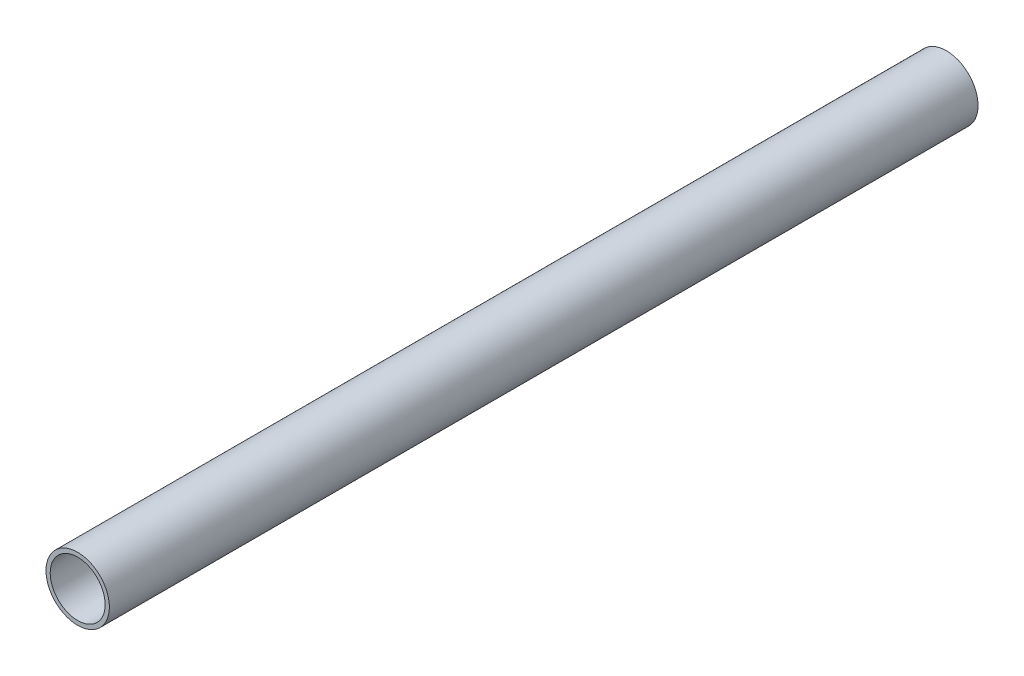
from build123d import *

# Parameters (mm, degrees)
SKETCH1_R           = 11.1125
SKETCH1_R_2         = 9.6393
EXTRUDE_THIN1_DEPTH = 304.8


with BuildPart() as part:
    # Sketch1 → Extrude-Thin1 (new body)
    with BuildSketch(Plane.XY):
        Circle(SKETCH1_R)
        Circle(SKETCH1_R_2, mode=Mode.SUBTRACT)
    extrude(amount=EXTRUDE_THIN1_DEPTH)


solid = part.part
